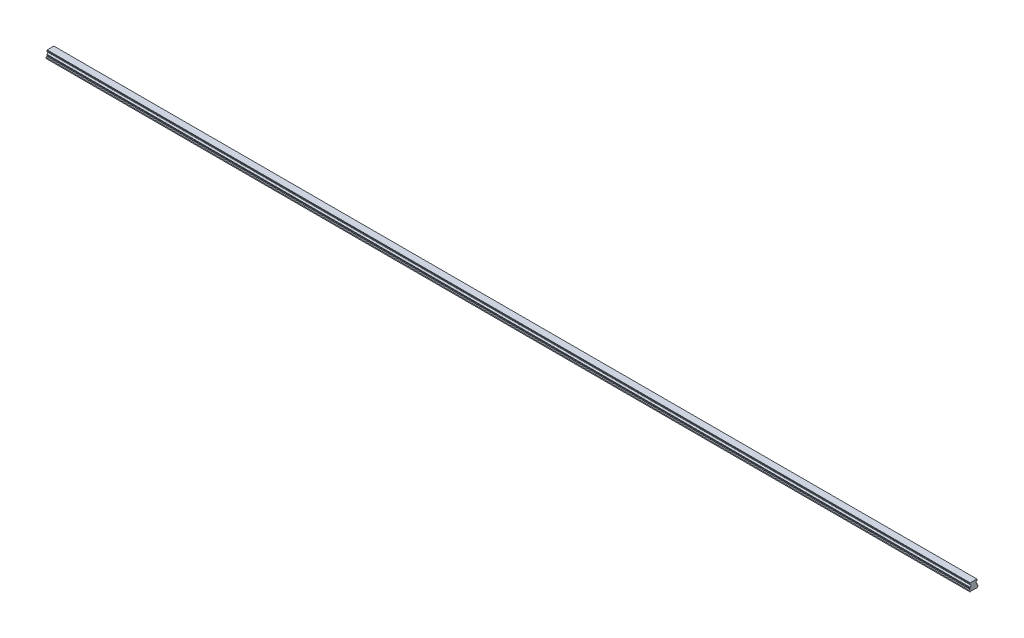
from build123d import *

# Parameters (mm, degrees)
BOSS_EXTRUDE1_DEPTH        = 2580
SKETCH3_R                  = 3
SKETCH3_R_2                = 2.5
CUT_EXTRUDE3_DEPTH         = 12
SKETCH3_2_R                = 2.5
CUT_EXTRUDE4_DEPTH         = 15
CHAMFER1_SIZE              = 0.5
LPATTERN4_COUNT            = 43
LPATTERN4_PITCH            = 60
CHAMFER1_OF_LPATTERN4_SIZE = 0.5


with BuildPart() as part:
    # Sketch1 → Boss-Extrude1 (new body)
    with BuildSketch(Plane(origin=(0, 0, 0), x_dir=(0, 0, -1), z_dir=(1, 0, 0))):
        with BuildLine():
            Line((9.375, 21.8), (-9.375, 21.8))
            Line((-9.375, 21.8), (-9.375, 20.756))
            Line((-9.375, 20.756), (-10, 19.415683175))
            Line((-10, 19.415683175), (-10, 17.685449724))
            ThreePointArc((-10, 17.685449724), (-7.2, 14.6), (-10, 11.514550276))
            Line((-10, 11.514550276), (-10, 9.784316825))
            Line((-10, 9.784316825), (-9.375, 8.444))
            Line((-9.375, 8.444), (-9.922688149, 6.4))
            Line((-9.922688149, 6.4), (-12.5, 5.489338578))
            Line((-12.5, 5.489338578), (-12.5, 2.65))
            Line((-12.5, 2.65), (-9.85, 0))
            Line((-9.85, 0), (-5.5, 0))
            Line((-5.5, 0), (-5, 0.5))
            Line((-5, 0.5), (5, 0.5))
            Line((5, 0.5), (5.5, 0))
            Line((5.5, 0), (9.85, 0))
            Line((9.85, 0), (12.5, 2.65))
            Line((12.5, 2.65), (12.5, 5.489338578))
            Line((12.5, 5.489338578), (9.922688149, 6.4))
            Line((9.922688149, 6.4), (9.375, 8.444))
            Line((9.375, 8.444), (10, 9.784316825))
            Line((10, 9.784316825), (10, 11.514550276))
            ThreePointArc((10, 11.514550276), (7.2, 14.6), (10, 17.685449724))
            Line((10, 17.685449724), (10, 19.415683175))
            Line((10, 19.415683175), (9.375, 20.756))
            Line((9.375, 20.756), (9.375, 21.8))
        make_face()
    extrude(amount=BOSS_EXTRUDE1_DEPTH)

    # Sketch3 → Cut-Extrude3 (cut)
    with BuildSketch(Plane.XZ):
        with Locations(Location((30, 0, 0), (0, 0, 270))):
            Circle(SKETCH3_R)
        with Locations(Location((30, 0, 0), (0, 0, 270))):
            Circle(SKETCH3_R_2, mode=Mode.SUBTRACT)
    cut_extrude3 = extrude(amount=-CUT_EXTRUDE3_DEPTH, mode=Mode.SUBTRACT)

    # Sketch3_2 → Cut-Extrude4 (cut)
    with BuildSketch(Plane.XZ):
        with Locations(Location((30, 0, 0), (0, 0, 270))):
            Circle(SKETCH3_2_R)
    cut_extrude4 = extrude(amount=-CUT_EXTRUDE4_DEPTH, mode=Mode.SUBTRACT)

    # Cut-Extrude5 cone 1 section (on through the dimple's axis) → Cut-Extrude5 (revolve, cut)
    with BuildSketch(Plane(origin=(30, 15, 0), x_dir=(0, 0, -1), z_dir=(1, 0, 0))):
        Polygon((0, 0), (2.5, 0), (0, 1.443375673), align=None)
    cut_extrude5 = revolve(axis=Axis((30, 15, 0), (0, 1, 0)), mode=Mode.SUBTRACT)

    # Chamfer1
    chamfer1_edges = [part.edges().sort_by_distance(p)[0] for p in [
        (30, 0.5, 3),
    ]]
    chamfer(chamfer1_edges, length=CHAMFER1_SIZE)

    # LPattern4: Cut-Extrude3, Cut-Extrude4, Cut-Extrude5 ×43
    with Locations(*[(i * LPATTERN4_PITCH, 0, 0) for i in range(1, LPATTERN4_COUNT)]):
        add(cut_extrude3, mode=Mode.SUBTRACT)
        add(cut_extrude4, mode=Mode.SUBTRACT)
        add(cut_extrude5, mode=Mode.SUBTRACT)

    # Chamfer1 of LPattern4
    chamfer1_of_lpattern4_edges = [part.edges().sort_by_distance(p)[0] for p in [
        (90, 0.5, 3),
        (150, 0.5, 3),
        (210, 0.5, 3),
        (270, 0.5, 3),
        (330, 0.5, 3),
        (390, 0.5, 3),
        (450, 0.5, 3),
        (510, 0.5, 3),
        (570, 0.5, 3),
        (630, 0.5, 3),
        (690, 0.5, 3),
        (750, 0.5, 3),
        (810, 0.5, 3),
        (870, 0.5, 3),
        (930, 0.5, 3),
        (990, 0.5, 3),
        (1050, 0.5, 3),
        (1110, 0.5, 3),
        (1170, 0.5, 3),
        (1230, 0.5, 3),
        (1290, 0.5, 3),
        (1350, 0.5, 3),
        (1410, 0.5, 3),
        (1470, 0.5, 3),
        (1530, 0.5, 3),
        (1590, 0.5, 3),
        (1650, 0.5, 3),
        (1710, 0.5, 3),
        (1770, 0.5, 3),
        (1830, 0.5, 3),
        (1890, 0.5, 3),
        (1950, 0.5, 3),
        (2010, 0.5, 3),
        (2070, 0.5, 3),
        (2130, 0.5, 3),
        (2190, 0.5, 3),
        (2250, 0.5, 3),
        (2310, 0.5, 3),
        (2370, 0.5, 3),
        (2430, 0.5, 3),
        (2490, 0.5, 3),
        (2550, 0.5, 3),
    ]]
    chamfer(chamfer1_of_lpattern4_edges, length=CHAMFER1_OF_LPATTERN4_SIZE)


solid = part.part
